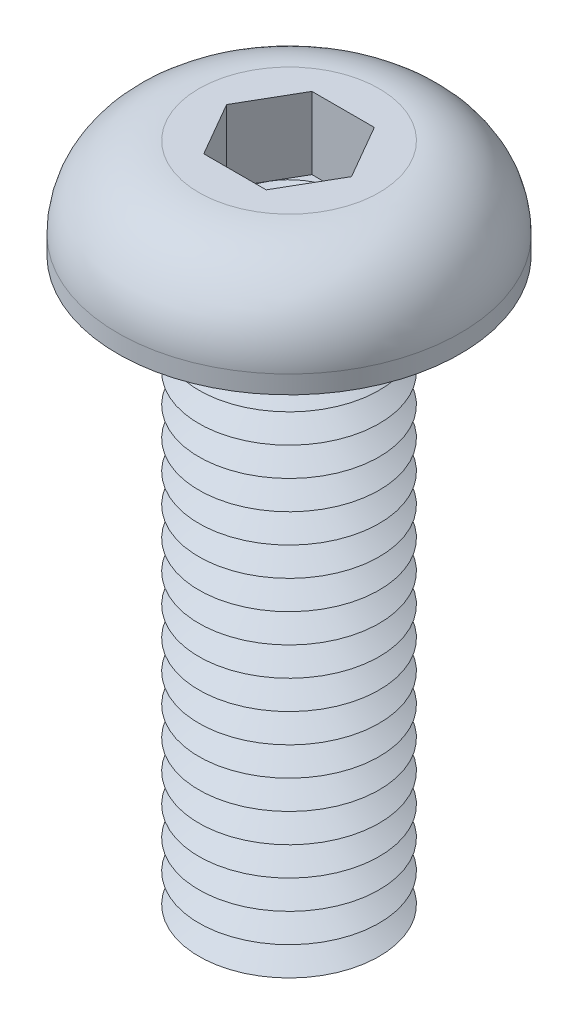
ISO-10303-21;
HEADER;
FILE_DESCRIPTION(('STEP AP214'),'2;1');
FILE_NAME('part.step','',(''),(''),'','','');
FILE_SCHEMA(('AUTOMOTIVE_DESIGN { 1 0 10303 214 1 1 1 1 }'));
ENDSEC;
DATA;
#1=APPLICATION_CONTEXT('core data for automotive mechanical design processes');
#2=APPLICATION_PROTOCOL_DEFINITION('international standard','automotive_design',2000,#1);
#3=PRODUCT_CONTEXT('',#1,'mechanical');
#4=PRODUCT('Part','Part','',(#3));
#5=PRODUCT_RELATED_PRODUCT_CATEGORY('part','',(#4));
#6=PRODUCT_DEFINITION_FORMATION('','',#4);
#7=PRODUCT_DEFINITION_CONTEXT('part definition',#1,'design');
#8=PRODUCT_DEFINITION('design','',#6,#7);
#9=PRODUCT_DEFINITION_SHAPE('','',#8);
#10=(LENGTH_UNIT() NAMED_UNIT(*) SI_UNIT(.MILLI.,.METRE.));
#11=(NAMED_UNIT(*) PLANE_ANGLE_UNIT() SI_UNIT($,.RADIAN.));
#12=(NAMED_UNIT(*) SI_UNIT($,.STERADIAN.) SOLID_ANGLE_UNIT());
#13=UNCERTAINTY_MEASURE_WITH_UNIT(LENGTH_MEASURE(1.E-05),#10,'distance_accuracy_value','');
#14=(GEOMETRIC_REPRESENTATION_CONTEXT(3) GLOBAL_UNCERTAINTY_ASSIGNED_CONTEXT((#13)) GLOBAL_UNIT_ASSIGNED_CONTEXT((#10,
#11,#12)) REPRESENTATION_CONTEXT('',''));
#15=CARTESIAN_POINT('',(0.,0.,0.));
#16=DIRECTION('',(0.,0.,1.));
#17=DIRECTION('',(1.,0.,0.));
#18=AXIS2_PLACEMENT_3D('',#15,#16,#17);
#19=CARTESIAN_POINT('',(0.,0.,0.));
#20=DIRECTION('',(0.,-1.,0.));
#21=DIRECTION('',(0.,0.,-1.));
#22=AXIS2_PLACEMENT_3D('',#19,#20,#21);
#23=TOROIDAL_SURFACE('',#22,2.9,0.4);
#24=CARTESIAN_POINT('',(0.,0.,-3.3));
#25=VERTEX_POINT('',#24);
#26=VERTEX_LOOP('',#25);
#27=FACE_BOUND('',#26,.T.);
#28=ADVANCED_FACE('P0_F12',(#27),#23,.T.);
#29=CLOSED_SHELL('',(#28));
#30=MANIFOLD_SOLID_BREP('P0_B1',#29);
#31=CARTESIAN_POINT('',(0.866025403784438,0.75,-1.5));
#32=DIRECTION('',(0.,1.,0.));
#33=DIRECTION('',(0.,0.,1.));
#34=AXIS2_PLACEMENT_3D('',#31,#32,#33);
#35=PLANE('',#34);
#36=CARTESIAN_POINT('',(0.,0.75,0.));
#37=DIRECTION('',(0.,1.,0.));
#38=DIRECTION('',(0.,0.,1.));
#39=AXIS2_PLACEMENT_3D('',#36,#37,#38);
#40=CIRCLE('',#39,1.5);
#41=CARTESIAN_POINT('',(0.,0.75,1.5));
#42=VERTEX_POINT('',#41);
#43=CARTESIAN_POINT('',(1.29903810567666,0.75,0.75));
#44=VERTEX_POINT('',#43);
#45=EDGE_CURVE('P1_E93',#42,#44,#40,.T.);
#46=ORIENTED_EDGE('',*,*,#45,.F.);
#47=DIRECTION('',(1.,0.,0.));
#48=VECTOR('',#47,1.);
#49=CARTESIAN_POINT('',(-0.866025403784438,0.75,1.5));
#50=LINE('',#49,#48);
#51=CARTESIAN_POINT('',(0.866025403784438,0.75,1.5));
#52=VERTEX_POINT('',#51);
#53=EDGE_CURVE('P1_E116',#42,#52,#50,.T.);
#54=ORIENTED_EDGE('',*,*,#53,.T.);
#55=DIRECTION('',(0.5,0.,-0.866025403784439));
#56=VECTOR('',#55,1.);
#57=CARTESIAN_POINT('',(0.866025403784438,0.75,1.5));
#58=LINE('',#57,#56);
#59=EDGE_CURVE('P1_E112',#52,#44,#58,.T.);
#60=ORIENTED_EDGE('',*,*,#59,.T.);
#61=EDGE_LOOP('',(#46,#54,#60));
#62=FACE_BOUND('',#61,.T.);
#63=ADVANCED_FACE('P1_F15',(#62),#35,.T.);
#64=CARTESIAN_POINT('',(0.,0.75,0.));
#65=DIRECTION('',(0.,1.,0.));
#66=DIRECTION('',(0.,0.,1.));
#67=AXIS2_PLACEMENT_3D('',#64,#65,#66);
#68=CIRCLE('',#67,1.5);
#69=CARTESIAN_POINT('',(1.29903810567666,0.75,-0.750000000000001));
#70=VERTEX_POINT('',#69);
#71=EDGE_CURVE('P1_E10',#44,#70,#68,.T.);
#72=ORIENTED_EDGE('',*,*,#71,.F.);
#73=CARTESIAN_POINT('',(1.73205080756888,0.75,0.));
#74=VERTEX_POINT('',#73);
#75=EDGE_CURVE('P1_E104',#44,#74,#58,.T.);
#76=ORIENTED_EDGE('',*,*,#75,.T.);
#77=DIRECTION('',(-0.5,0.,-0.866025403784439));
#78=VECTOR('',#77,1.);
#79=CARTESIAN_POINT('',(1.73205080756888,0.75,0.));
#80=LINE('',#79,#78);
#81=EDGE_CURVE('P1_E107',#74,#70,#80,.T.);
#82=ORIENTED_EDGE('',*,*,#81,.T.);
#83=EDGE_LOOP('',(#72,#76,#82));
#84=FACE_BOUND('',#83,.T.);
#85=ADVANCED_FACE('P1_F103',(#84),#35,.T.);
#86=CARTESIAN_POINT('',(0.,0.75,-1.5));
#87=VERTEX_POINT('',#86);
#88=EDGE_CURVE('P1_E24',#70,#87,#68,.T.);
#89=ORIENTED_EDGE('',*,*,#88,.F.);
#90=CARTESIAN_POINT('',(0.866025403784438,0.75,-1.5));
#91=VERTEX_POINT('',#90);
#92=EDGE_CURVE('P1_E139',#70,#91,#80,.T.);
#93=ORIENTED_EDGE('',*,*,#92,.T.);
#94=DIRECTION('',(-1.,0.,0.));
#95=VECTOR('',#94,1.);
#96=CARTESIAN_POINT('',(0.866025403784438,0.75,-1.5));
#97=LINE('',#96,#95);
#98=EDGE_CURVE('P1_E336',#91,#87,#97,.T.);
#99=ORIENTED_EDGE('',*,*,#98,.T.);
#100=EDGE_LOOP('',(#89,#93,#99));
#101=FACE_BOUND('',#100,.T.);
#102=ADVANCED_FACE('P1_F301',(#101),#35,.T.);
#103=CARTESIAN_POINT('',(-1.29903810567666,0.75,-0.75));
#104=VERTEX_POINT('',#103);
#105=EDGE_CURVE('P1_E331',#87,#104,#68,.T.);
#106=ORIENTED_EDGE('',*,*,#105,.F.);
#107=CARTESIAN_POINT('',(-0.866025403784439,0.75,-1.5));
#108=VERTEX_POINT('',#107);
#109=EDGE_CURVE('P1_E340',#87,#108,#97,.T.);
#110=ORIENTED_EDGE('',*,*,#109,.T.);
#111=DIRECTION('',(-0.5,0.,0.866025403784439));
#112=VECTOR('',#111,1.);
#113=CARTESIAN_POINT('',(-0.866025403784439,0.75,-1.5));
#114=LINE('',#113,#112);
#115=EDGE_CURVE('P1_E335',#108,#104,#114,.T.);
#116=ORIENTED_EDGE('',*,*,#115,.T.);
#117=EDGE_LOOP('',(#106,#110,#116));
#118=FACE_BOUND('',#117,.T.);
#119=ADVANCED_FACE('P1_F315',(#118),#35,.T.);
#120=CARTESIAN_POINT('',(-1.29903810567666,0.75,0.75));
#121=VERTEX_POINT('',#120);
#122=EDGE_CURVE('P1_E31',#104,#121,#68,.T.);
#123=ORIENTED_EDGE('',*,*,#122,.F.);
#124=CARTESIAN_POINT('',(-1.73205080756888,0.75,0.));
#125=VERTEX_POINT('',#124);
#126=EDGE_CURVE('P1_E327',#104,#125,#114,.T.);
#127=ORIENTED_EDGE('',*,*,#126,.T.);
#128=DIRECTION('',(0.5,0.,0.866025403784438));
#129=VECTOR('',#128,1.);
#130=CARTESIAN_POINT('',(-1.73205080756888,0.75,0.));
#131=LINE('',#130,#129);
#132=EDGE_CURVE('P1_E330',#125,#121,#131,.T.);
#133=ORIENTED_EDGE('',*,*,#132,.T.);
#134=EDGE_LOOP('',(#123,#127,#133));
#135=FACE_BOUND('',#134,.T.);
#136=ADVANCED_FACE('P1_F306',(#135),#35,.T.);
#137=CARTESIAN_POINT('',(0.,-15.2,0.));
#138=DIRECTION('',(0.,1.,0.));
#139=DIRECTION('',(0.,0.,1.));
#140=AXIS2_PLACEMENT_3D('',#137,#138,#139);
#141=CONICAL_SURFACE('',#140,1.80717967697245,1.0471975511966);
#142=CARTESIAN_POINT('',(0.,-14.8,0.));
#143=DIRECTION('',(0.,-1.,0.));
#144=DIRECTION('',(0.,0.,-1.));
#145=AXIS2_PLACEMENT_3D('',#142,#143,#144);
#146=CIRCLE('',#145,2.5);
#147=CARTESIAN_POINT('',(0.,-14.8,-2.5));
#148=VERTEX_POINT('',#147);
#149=EDGE_CURVE('P1_E263',#148,#148,#146,.T.);
#150=ORIENTED_EDGE('',*,*,#149,.T.);
#151=EDGE_LOOP('',(#150));
#152=FACE_BOUND('',#151,.T.);
#153=CARTESIAN_POINT('',(0.,-15.2,0.));
#154=DIRECTION('',(0.,-1.,0.));
#155=DIRECTION('',(0.,0.,-1.));
#156=AXIS2_PLACEMENT_3D('',#153,#154,#155);
#157=CIRCLE('',#156,1.80717967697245);
#158=CARTESIAN_POINT('',(0.,-15.2,-1.80717967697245));
#159=VERTEX_POINT('',#158);
#160=EDGE_CURVE('P1_E266',#159,#159,#157,.T.);
#161=ORIENTED_EDGE('',*,*,#160,.F.);
#162=EDGE_LOOP('',(#161));
#163=FACE_BOUND('',#162,.T.);
#164=ADVANCED_FACE('P1_F314',(#152,#163),#141,.T.);
#165=CARTESIAN_POINT('',(0.,-15.6,0.));
#166=DIRECTION('',(0.,-1.,0.));
#167=DIRECTION('',(0.,0.,-1.));
#168=AXIS2_PLACEMENT_3D('',#165,#166,#167);
#169=CONICAL_SURFACE('',#168,2.5,1.0471975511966);
#170=ORIENTED_EDGE('',*,*,#160,.T.);
#171=EDGE_LOOP('',(#170));
#172=FACE_BOUND('',#171,.T.);
#173=CARTESIAN_POINT('',(0.,-15.6,0.));
#174=DIRECTION('',(0.,-1.,0.));
#175=DIRECTION('',(0.,0.,-1.));
#176=AXIS2_PLACEMENT_3D('',#173,#174,#175);
#177=CIRCLE('',#176,2.5);
#178=CARTESIAN_POINT('',(0.,-15.6,-2.5));
#179=VERTEX_POINT('',#178);
#180=EDGE_CURVE('P1_E269',#179,#179,#177,.T.);
#181=ORIENTED_EDGE('',*,*,#180,.F.);
#182=EDGE_LOOP('',(#181));
#183=FACE_BOUND('',#182,.T.);
#184=ADVANCED_FACE('P1_F321',(#172,#183),#169,.T.);
#185=CARTESIAN_POINT('',(0.,-16.,0.));
#186=DIRECTION('',(0.,1.,0.));
#187=DIRECTION('',(0.,0.,1.));
#188=AXIS2_PLACEMENT_3D('',#185,#186,#187);
#189=PLANE('',#188);
#190=CARTESIAN_POINT('',(0.,-16.,0.));
#191=DIRECTION('',(0.,-1.,0.));
#192=DIRECTION('',(0.,0.,-1.));
#193=AXIS2_PLACEMENT_3D('',#190,#191,#192);
#194=CIRCLE('',#193,1.80717967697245);
#195=CARTESIAN_POINT('',(0.,-16.,-1.80717967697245));
#196=VERTEX_POINT('',#195);
#197=EDGE_CURVE('P1_E272',#196,#196,#194,.T.);
#198=ORIENTED_EDGE('',*,*,#197,.T.);
#199=EDGE_LOOP('',(#198));
#200=FACE_BOUND('',#199,.T.);
#201=ADVANCED_FACE('P1_F399',(#200),#189,.F.);
#202=CARTESIAN_POINT('',(0.,-16.,0.));
#203=DIRECTION('',(0.,1.,0.));
#204=DIRECTION('',(0.,0.,1.));
#205=AXIS2_PLACEMENT_3D('',#202,#203,#204);
#206=CONICAL_SURFACE('',#205,1.80717967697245,1.0471975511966);
#207=ORIENTED_EDGE('',*,*,#180,.T.);
#208=EDGE_LOOP('',(#207));
#209=FACE_BOUND('',#208,.T.);
#210=ORIENTED_EDGE('',*,*,#197,.F.);
#211=EDGE_LOOP('',(#210));
#212=FACE_BOUND('',#211,.T.);
#213=ADVANCED_FACE('P1_F410',(#209,#212),#206,.T.);
#214=CARTESIAN_POINT('',(0.,-14.4,0.));
#215=DIRECTION('',(0.,1.,0.));
#216=DIRECTION('',(0.,0.,1.));
#217=AXIS2_PLACEMENT_3D('',#214,#215,#216);
#218=CONICAL_SURFACE('',#217,1.80717967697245,1.0471975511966);
#219=CARTESIAN_POINT('',(0.,-14.,0.));
#220=DIRECTION('',(0.,-1.,0.));
#221=DIRECTION('',(0.,0.,-1.));
#222=AXIS2_PLACEMENT_3D('',#219,#220,#221);
#223=CIRCLE('',#222,2.5);
#224=CARTESIAN_POINT('',(0.,-14.,-2.5));
#225=VERTEX_POINT('',#224);
#226=EDGE_CURVE('P1_E257',#225,#225,#223,.T.);
#227=ORIENTED_EDGE('',*,*,#226,.T.);
#228=EDGE_LOOP('',(#227));
#229=FACE_BOUND('',#228,.T.);
#230=CARTESIAN_POINT('',(0.,-14.4,0.));
#231=DIRECTION('',(0.,-1.,0.));
#232=DIRECTION('',(0.,0.,-1.));
#233=AXIS2_PLACEMENT_3D('',#230,#231,#232);
#234=CIRCLE('',#233,1.80717967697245);
#235=CARTESIAN_POINT('',(0.,-14.4,-1.80717967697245));
#236=VERTEX_POINT('',#235);
#237=EDGE_CURVE('P1_E260',#236,#236,#234,.T.);
#238=ORIENTED_EDGE('',*,*,#237,.F.);
#239=EDGE_LOOP('',(#238));
#240=FACE_BOUND('',#239,.T.);
#241=ADVANCED_FACE('P1_F419',(#229,#240),#218,.T.);
#242=CARTESIAN_POINT('',(0.,-14.8,0.));
#243=DIRECTION('',(0.,-1.,0.));
#244=DIRECTION('',(0.,0.,-1.));
#245=AXIS2_PLACEMENT_3D('',#242,#243,#244);
#246=CONICAL_SURFACE('',#245,2.5,1.0471975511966);
#247=ORIENTED_EDGE('',*,*,#237,.T.);
#248=EDGE_LOOP('',(#247));
#249=FACE_BOUND('',#248,.T.);
#250=ORIENTED_EDGE('',*,*,#149,.F.);
#251=EDGE_LOOP('',(#250));
#252=FACE_BOUND('',#251,.T.);
#253=ADVANCED_FACE('P1_F428',(#249,#252),#246,.T.);
#254=CARTESIAN_POINT('',(0.,-13.6,0.));
#255=DIRECTION('',(0.,1.,0.));
#256=DIRECTION('',(0.,0.,1.));
#257=AXIS2_PLACEMENT_3D('',#254,#255,#256);
#258=CONICAL_SURFACE('',#257,1.80717967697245,1.0471975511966);
#259=CARTESIAN_POINT('',(0.,-13.2,0.));
#260=DIRECTION('',(0.,-1.,0.));
#261=DIRECTION('',(0.,0.,-1.));
#262=AXIS2_PLACEMENT_3D('',#259,#260,#261);
#263=CIRCLE('',#262,2.5);
#264=CARTESIAN_POINT('',(0.,-13.2,-2.5));
#265=VERTEX_POINT('',#264);
#266=EDGE_CURVE('P1_E251',#265,#265,#263,.T.);
#267=ORIENTED_EDGE('',*,*,#266,.T.);
#268=EDGE_LOOP('',(#267));
#269=FACE_BOUND('',#268,.T.);
#270=CARTESIAN_POINT('',(0.,-13.6,0.));
#271=DIRECTION('',(0.,-1.,0.));
#272=DIRECTION('',(0.,0.,-1.));
#273=AXIS2_PLACEMENT_3D('',#270,#271,#272);
#274=CIRCLE('',#273,1.80717967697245);
#275=CARTESIAN_POINT('',(0.,-13.6,-1.80717967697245));
#276=VERTEX_POINT('',#275);
#277=EDGE_CURVE('P1_E254',#276,#276,#274,.T.);
#278=ORIENTED_EDGE('',*,*,#277,.F.);
#279=EDGE_LOOP('',(#278));
#280=FACE_BOUND('',#279,.T.);
#281=ADVANCED_FACE('P1_F438',(#269,#280),#258,.T.);
#282=CARTESIAN_POINT('',(0.,-14.,0.));
#283=DIRECTION('',(0.,-1.,0.));
#284=DIRECTION('',(0.,0.,-1.));
#285=AXIS2_PLACEMENT_3D('',#282,#283,#284);
#286=CONICAL_SURFACE('',#285,2.5,1.0471975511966);
#287=ORIENTED_EDGE('',*,*,#277,.T.);
#288=EDGE_LOOP('',(#287));
#289=FACE_BOUND('',#288,.T.);
#290=ORIENTED_EDGE('',*,*,#226,.F.);
#291=EDGE_LOOP('',(#290));
#292=FACE_BOUND('',#291,.T.);
#293=ADVANCED_FACE('P1_F448',(#289,#292),#286,.T.);
#294=CARTESIAN_POINT('',(0.,-12.8,0.));
#295=DIRECTION('',(0.,1.,0.));
#296=DIRECTION('',(0.,0.,1.));
#297=AXIS2_PLACEMENT_3D('',#294,#295,#296);
#298=CONICAL_SURFACE('',#297,1.80717967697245,1.0471975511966);
#299=CARTESIAN_POINT('',(0.,-12.4,0.));
#300=DIRECTION('',(0.,-1.,0.));
#301=DIRECTION('',(0.,0.,-1.));
#302=AXIS2_PLACEMENT_3D('',#299,#300,#301);
#303=CIRCLE('',#302,2.5);
#304=CARTESIAN_POINT('',(0.,-12.4,-2.5));
#305=VERTEX_POINT('',#304);
#306=EDGE_CURVE('P1_E245',#305,#305,#303,.T.);
#307=ORIENTED_EDGE('',*,*,#306,.T.);
#308=EDGE_LOOP('',(#307));
#309=FACE_BOUND('',#308,.T.);
#310=CARTESIAN_POINT('',(0.,-12.8,0.));
#311=DIRECTION('',(0.,-1.,0.));
#312=DIRECTION('',(0.,0.,-1.));
#313=AXIS2_PLACEMENT_3D('',#310,#311,#312);
#314=CIRCLE('',#313,1.80717967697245);
#315=CARTESIAN_POINT('',(0.,-12.8,-1.80717967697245));
#316=VERTEX_POINT('',#315);
#317=EDGE_CURVE('P1_E248',#316,#316,#314,.T.);
#318=ORIENTED_EDGE('',*,*,#317,.F.);
#319=EDGE_LOOP('',(#318));
#320=FACE_BOUND('',#319,.T.);
#321=ADVANCED_FACE('P1_F458',(#309,#320),#298,.T.);
#322=CARTESIAN_POINT('',(0.,-13.2,0.));
#323=DIRECTION('',(0.,-1.,0.));
#324=DIRECTION('',(0.,0.,-1.));
#325=AXIS2_PLACEMENT_3D('',#322,#323,#324);
#326=CONICAL_SURFACE('',#325,2.5,1.0471975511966);
#327=ORIENTED_EDGE('',*,*,#317,.T.);
#328=EDGE_LOOP('',(#327));
#329=FACE_BOUND('',#328,.T.);
#330=ORIENTED_EDGE('',*,*,#266,.F.);
#331=EDGE_LOOP('',(#330));
#332=FACE_BOUND('',#331,.T.);
#333=ADVANCED_FACE('P1_F468',(#329,#332),#326,.T.);
#334=CARTESIAN_POINT('',(0.,-12.,0.));
#335=DIRECTION('',(0.,1.,0.));
#336=DIRECTION('',(0.,0.,1.));
#337=AXIS2_PLACEMENT_3D('',#334,#335,#336);
#338=CONICAL_SURFACE('',#337,1.80717967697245,1.0471975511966);
#339=CARTESIAN_POINT('',(0.,-11.6,0.));
#340=DIRECTION('',(0.,-1.,0.));
#341=DIRECTION('',(0.,0.,-1.));
#342=AXIS2_PLACEMENT_3D('',#339,#340,#341);
#343=CIRCLE('',#342,2.5);
#344=CARTESIAN_POINT('',(0.,-11.6,-2.5));
#345=VERTEX_POINT('',#344);
#346=EDGE_CURVE('P1_E239',#345,#345,#343,.T.);
#347=ORIENTED_EDGE('',*,*,#346,.T.);
#348=EDGE_LOOP('',(#347));
#349=FACE_BOUND('',#348,.T.);
#350=CARTESIAN_POINT('',(0.,-12.,0.));
#351=DIRECTION('',(0.,-1.,0.));
#352=DIRECTION('',(0.,0.,-1.));
#353=AXIS2_PLACEMENT_3D('',#350,#351,#352);
#354=CIRCLE('',#353,1.80717967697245);
#355=CARTESIAN_POINT('',(0.,-12.,-1.80717967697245));
#356=VERTEX_POINT('',#355);
#357=EDGE_CURVE('P1_E242',#356,#356,#354,.T.);
#358=ORIENTED_EDGE('',*,*,#357,.F.);
#359=EDGE_LOOP('',(#358));
#360=FACE_BOUND('',#359,.T.);
#361=ADVANCED_FACE('P1_F478',(#349,#360),#338,.T.);
#362=CARTESIAN_POINT('',(0.,-12.4,0.));
#363=DIRECTION('',(0.,-1.,0.));
#364=DIRECTION('',(0.,0.,-1.));
#365=AXIS2_PLACEMENT_3D('',#362,#363,#364);
#366=CONICAL_SURFACE('',#365,2.5,1.0471975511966);
#367=ORIENTED_EDGE('',*,*,#357,.T.);
#368=EDGE_LOOP('',(#367));
#369=FACE_BOUND('',#368,.T.);
#370=ORIENTED_EDGE('',*,*,#306,.F.);
#371=EDGE_LOOP('',(#370));
#372=FACE_BOUND('',#371,.T.);
#373=ADVANCED_FACE('P1_F488',(#369,#372),#366,.T.);
#374=CARTESIAN_POINT('',(0.,-11.2,0.));
#375=DIRECTION('',(0.,1.,0.));
#376=DIRECTION('',(0.,0.,1.));
#377=AXIS2_PLACEMENT_3D('',#374,#375,#376);
#378=CONICAL_SURFACE('',#377,1.80717967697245,1.0471975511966);
#379=CARTESIAN_POINT('',(0.,-10.8,0.));
#380=DIRECTION('',(0.,-1.,0.));
#381=DIRECTION('',(0.,0.,-1.));
#382=AXIS2_PLACEMENT_3D('',#379,#380,#381);
#383=CIRCLE('',#382,2.5);
#384=CARTESIAN_POINT('',(0.,-10.8,-2.5));
#385=VERTEX_POINT('',#384);
#386=EDGE_CURVE('P1_E233',#385,#385,#383,.T.);
#387=ORIENTED_EDGE('',*,*,#386,.T.);
#388=EDGE_LOOP('',(#387));
#389=FACE_BOUND('',#388,.T.);
#390=CARTESIAN_POINT('',(0.,-11.2,0.));
#391=DIRECTION('',(0.,-1.,0.));
#392=DIRECTION('',(0.,0.,-1.));
#393=AXIS2_PLACEMENT_3D('',#390,#391,#392);
#394=CIRCLE('',#393,1.80717967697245);
#395=CARTESIAN_POINT('',(0.,-11.2,-1.80717967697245));
#396=VERTEX_POINT('',#395);
#397=EDGE_CURVE('P1_E236',#396,#396,#394,.T.);
#398=ORIENTED_EDGE('',*,*,#397,.F.);
#399=EDGE_LOOP('',(#398));
#400=FACE_BOUND('',#399,.T.);
#401=ADVANCED_FACE('P1_F498',(#389,#400),#378,.T.);
#402=CARTESIAN_POINT('',(0.,-11.6,0.));
#403=DIRECTION('',(0.,-1.,0.));
#404=DIRECTION('',(0.,0.,-1.));
#405=AXIS2_PLACEMENT_3D('',#402,#403,#404);
#406=CONICAL_SURFACE('',#405,2.5,1.0471975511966);
#407=ORIENTED_EDGE('',*,*,#397,.T.);
#408=EDGE_LOOP('',(#407));
#409=FACE_BOUND('',#408,.T.);
#410=ORIENTED_EDGE('',*,*,#346,.F.);
#411=EDGE_LOOP('',(#410));
#412=FACE_BOUND('',#411,.T.);
#413=ADVANCED_FACE('P1_F508',(#409,#412),#406,.T.);
#414=CARTESIAN_POINT('',(0.,-10.4,0.));
#415=DIRECTION('',(0.,1.,0.));
#416=DIRECTION('',(0.,0.,1.));
#417=AXIS2_PLACEMENT_3D('',#414,#415,#416);
#418=CONICAL_SURFACE('',#417,1.80717967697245,1.0471975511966);
#419=CARTESIAN_POINT('',(0.,-10.,0.));
#420=DIRECTION('',(0.,-1.,0.));
#421=DIRECTION('',(0.,0.,-1.));
#422=AXIS2_PLACEMENT_3D('',#419,#420,#421);
#423=CIRCLE('',#422,2.5);
#424=CARTESIAN_POINT('',(0.,-10.,-2.5));
#425=VERTEX_POINT('',#424);
#426=EDGE_CURVE('P1_E227',#425,#425,#423,.T.);
#427=ORIENTED_EDGE('',*,*,#426,.T.);
#428=EDGE_LOOP('',(#427));
#429=FACE_BOUND('',#428,.T.);
#430=CARTESIAN_POINT('',(0.,-10.4,0.));
#431=DIRECTION('',(0.,-1.,0.));
#432=DIRECTION('',(0.,0.,-1.));
#433=AXIS2_PLACEMENT_3D('',#430,#431,#432);
#434=CIRCLE('',#433,1.80717967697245);
#435=CARTESIAN_POINT('',(0.,-10.4,-1.80717967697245));
#436=VERTEX_POINT('',#435);
#437=EDGE_CURVE('P1_E230',#436,#436,#434,.T.);
#438=ORIENTED_EDGE('',*,*,#437,.F.);
#439=EDGE_LOOP('',(#438));
#440=FACE_BOUND('',#439,.T.);
#441=ADVANCED_FACE('P1_F518',(#429,#440),#418,.T.);
#442=CARTESIAN_POINT('',(0.,-10.8,0.));
#443=DIRECTION('',(0.,-1.,0.));
#444=DIRECTION('',(0.,0.,-1.));
#445=AXIS2_PLACEMENT_3D('',#442,#443,#444);
#446=CONICAL_SURFACE('',#445,2.5,1.0471975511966);
#447=ORIENTED_EDGE('',*,*,#437,.T.);
#448=EDGE_LOOP('',(#447));
#449=FACE_BOUND('',#448,.T.);
#450=ORIENTED_EDGE('',*,*,#386,.F.);
#451=EDGE_LOOP('',(#450));
#452=FACE_BOUND('',#451,.T.);
#453=ADVANCED_FACE('P1_F528',(#449,#452),#446,.T.);
#454=CARTESIAN_POINT('',(0.,-9.6,0.));
#455=DIRECTION('',(0.,1.,0.));
#456=DIRECTION('',(0.,0.,1.));
#457=AXIS2_PLACEMENT_3D('',#454,#455,#456);
#458=CONICAL_SURFACE('',#457,1.80717967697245,1.0471975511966);
#459=CARTESIAN_POINT('',(0.,-9.2,0.));
#460=DIRECTION('',(0.,-1.,0.));
#461=DIRECTION('',(0.,0.,-1.));
#462=AXIS2_PLACEMENT_3D('',#459,#460,#461);
#463=CIRCLE('',#462,2.5);
#464=CARTESIAN_POINT('',(0.,-9.2,-2.5));
#465=VERTEX_POINT('',#464);
#466=EDGE_CURVE('P1_E221',#465,#465,#463,.T.);
#467=ORIENTED_EDGE('',*,*,#466,.T.);
#468=EDGE_LOOP('',(#467));
#469=FACE_BOUND('',#468,.T.);
#470=CARTESIAN_POINT('',(0.,-9.6,0.));
#471=DIRECTION('',(0.,-1.,0.));
#472=DIRECTION('',(0.,0.,-1.));
#473=AXIS2_PLACEMENT_3D('',#470,#471,#472);
#474=CIRCLE('',#473,1.80717967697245);
#475=CARTESIAN_POINT('',(0.,-9.6,-1.80717967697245));
#476=VERTEX_POINT('',#475);
#477=EDGE_CURVE('P1_E224',#476,#476,#474,.T.);
#478=ORIENTED_EDGE('',*,*,#477,.F.);
#479=EDGE_LOOP('',(#478));
#480=FACE_BOUND('',#479,.T.);
#481=ADVANCED_FACE('P1_F538',(#469,#480),#458,.T.);
#482=CARTESIAN_POINT('',(0.,-10.,0.));
#483=DIRECTION('',(0.,-1.,0.));
#484=DIRECTION('',(0.,0.,-1.));
#485=AXIS2_PLACEMENT_3D('',#482,#483,#484);
#486=CONICAL_SURFACE('',#485,2.5,1.0471975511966);
#487=ORIENTED_EDGE('',*,*,#477,.T.);
#488=EDGE_LOOP('',(#487));
#489=FACE_BOUND('',#488,.T.);
#490=ORIENTED_EDGE('',*,*,#426,.F.);
#491=EDGE_LOOP('',(#490));
#492=FACE_BOUND('',#491,.T.);
#493=ADVANCED_FACE('P1_F548',(#489,#492),#486,.T.);
#494=CARTESIAN_POINT('',(0.,-8.8,0.));
#495=DIRECTION('',(0.,1.,0.));
#496=DIRECTION('',(0.,0.,1.));
#497=AXIS2_PLACEMENT_3D('',#494,#495,#496);
#498=CONICAL_SURFACE('',#497,1.80717967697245,1.0471975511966);
#499=CARTESIAN_POINT('',(0.,-8.4,0.));
#500=DIRECTION('',(0.,-1.,0.));
#501=DIRECTION('',(0.,0.,-1.));
#502=AXIS2_PLACEMENT_3D('',#499,#500,#501);
#503=CIRCLE('',#502,2.5);
#504=CARTESIAN_POINT('',(0.,-8.4,-2.5));
#505=VERTEX_POINT('',#504);
#506=EDGE_CURVE('P1_E215',#505,#505,#503,.T.);
#507=ORIENTED_EDGE('',*,*,#506,.T.);
#508=EDGE_LOOP('',(#507));
#509=FACE_BOUND('',#508,.T.);
#510=CARTESIAN_POINT('',(0.,-8.8,0.));
#511=DIRECTION('',(0.,-1.,0.));
#512=DIRECTION('',(0.,0.,-1.));
#513=AXIS2_PLACEMENT_3D('',#510,#511,#512);
#514=CIRCLE('',#513,1.80717967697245);
#515=CARTESIAN_POINT('',(0.,-8.8,-1.80717967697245));
#516=VERTEX_POINT('',#515);
#517=EDGE_CURVE('P1_E218',#516,#516,#514,.T.);
#518=ORIENTED_EDGE('',*,*,#517,.F.);
#519=EDGE_LOOP('',(#518));
#520=FACE_BOUND('',#519,.T.);
#521=ADVANCED_FACE('P1_F558',(#509,#520),#498,.T.);
#522=CARTESIAN_POINT('',(0.,-9.2,0.));
#523=DIRECTION('',(0.,-1.,0.));
#524=DIRECTION('',(0.,0.,-1.));
#525=AXIS2_PLACEMENT_3D('',#522,#523,#524);
#526=CONICAL_SURFACE('',#525,2.5,1.0471975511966);
#527=ORIENTED_EDGE('',*,*,#517,.T.);
#528=EDGE_LOOP('',(#527));
#529=FACE_BOUND('',#528,.T.);
#530=ORIENTED_EDGE('',*,*,#466,.F.);
#531=EDGE_LOOP('',(#530));
#532=FACE_BOUND('',#531,.T.);
#533=ADVANCED_FACE('P1_F568',(#529,#532),#526,.T.);
#534=CARTESIAN_POINT('',(0.,-8.,0.));
#535=DIRECTION('',(0.,1.,0.));
#536=DIRECTION('',(0.,0.,1.));
#537=AXIS2_PLACEMENT_3D('',#534,#535,#536);
#538=CONICAL_SURFACE('',#537,1.80717967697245,1.0471975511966);
#539=CARTESIAN_POINT('',(0.,-7.6,0.));
#540=DIRECTION('',(0.,-1.,0.));
#541=DIRECTION('',(0.,0.,-1.));
#542=AXIS2_PLACEMENT_3D('',#539,#540,#541);
#543=CIRCLE('',#542,2.5);
#544=CARTESIAN_POINT('',(0.,-7.6,-2.5));
#545=VERTEX_POINT('',#544);
#546=EDGE_CURVE('P1_E209',#545,#545,#543,.T.);
#547=ORIENTED_EDGE('',*,*,#546,.T.);
#548=EDGE_LOOP('',(#547));
#549=FACE_BOUND('',#548,.T.);
#550=CARTESIAN_POINT('',(0.,-8.,0.));
#551=DIRECTION('',(0.,-1.,0.));
#552=DIRECTION('',(0.,0.,-1.));
#553=AXIS2_PLACEMENT_3D('',#550,#551,#552);
#554=CIRCLE('',#553,1.80717967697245);
#555=CARTESIAN_POINT('',(0.,-8.,-1.80717967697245));
#556=VERTEX_POINT('',#555);
#557=EDGE_CURVE('P1_E212',#556,#556,#554,.T.);
#558=ORIENTED_EDGE('',*,*,#557,.F.);
#559=EDGE_LOOP('',(#558));
#560=FACE_BOUND('',#559,.T.);
#561=ADVANCED_FACE('P1_F578',(#549,#560),#538,.T.);
#562=CARTESIAN_POINT('',(0.,-8.4,0.));
#563=DIRECTION('',(0.,-1.,0.));
#564=DIRECTION('',(0.,0.,-1.));
#565=AXIS2_PLACEMENT_3D('',#562,#563,#564);
#566=CONICAL_SURFACE('',#565,2.5,1.0471975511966);
#567=ORIENTED_EDGE('',*,*,#557,.T.);
#568=EDGE_LOOP('',(#567));
#569=FACE_BOUND('',#568,.T.);
#570=ORIENTED_EDGE('',*,*,#506,.F.);
#571=EDGE_LOOP('',(#570));
#572=FACE_BOUND('',#571,.T.);
#573=ADVANCED_FACE('P1_F588',(#569,#572),#566,.T.);
#574=CARTESIAN_POINT('',(0.,-7.2,0.));
#575=DIRECTION('',(0.,1.,0.));
#576=DIRECTION('',(0.,0.,1.));
#577=AXIS2_PLACEMENT_3D('',#574,#575,#576);
#578=CONICAL_SURFACE('',#577,1.80717967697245,1.0471975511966);
#579=CARTESIAN_POINT('',(0.,-6.8,0.));
#580=DIRECTION('',(0.,-1.,0.));
#581=DIRECTION('',(0.,0.,-1.));
#582=AXIS2_PLACEMENT_3D('',#579,#580,#581);
#583=CIRCLE('',#582,2.5);
#584=CARTESIAN_POINT('',(0.,-6.8,-2.5));
#585=VERTEX_POINT('',#584);
#586=EDGE_CURVE('P1_E203',#585,#585,#583,.T.);
#587=ORIENTED_EDGE('',*,*,#586,.T.);
#588=EDGE_LOOP('',(#587));
#589=FACE_BOUND('',#588,.T.);
#590=CARTESIAN_POINT('',(0.,-7.2,0.));
#591=DIRECTION('',(0.,-1.,0.));
#592=DIRECTION('',(0.,0.,-1.));
#593=AXIS2_PLACEMENT_3D('',#590,#591,#592);
#594=CIRCLE('',#593,1.80717967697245);
#595=CARTESIAN_POINT('',(0.,-7.2,-1.80717967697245));
#596=VERTEX_POINT('',#595);
#597=EDGE_CURVE('P1_E206',#596,#596,#594,.T.);
#598=ORIENTED_EDGE('',*,*,#597,.F.);
#599=EDGE_LOOP('',(#598));
#600=FACE_BOUND('',#599,.T.);
#601=ADVANCED_FACE('P1_F598',(#589,#600),#578,.T.);
#602=CARTESIAN_POINT('',(0.,-7.6,0.));
#603=DIRECTION('',(0.,-1.,0.));
#604=DIRECTION('',(0.,0.,-1.));
#605=AXIS2_PLACEMENT_3D('',#602,#603,#604);
#606=CONICAL_SURFACE('',#605,2.5,1.0471975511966);
#607=ORIENTED_EDGE('',*,*,#597,.T.);
#608=EDGE_LOOP('',(#607));
#609=FACE_BOUND('',#608,.T.);
#610=ORIENTED_EDGE('',*,*,#546,.F.);
#611=EDGE_LOOP('',(#610));
#612=FACE_BOUND('',#611,.T.);
#613=ADVANCED_FACE('P1_F608',(#609,#612),#606,.T.);
#614=CARTESIAN_POINT('',(0.,-6.4,0.));
#615=DIRECTION('',(0.,1.,0.));
#616=DIRECTION('',(0.,0.,1.));
#617=AXIS2_PLACEMENT_3D('',#614,#615,#616);
#618=CONICAL_SURFACE('',#617,1.80717967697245,1.0471975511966);
#619=CARTESIAN_POINT('',(0.,-6.,0.));
#620=DIRECTION('',(0.,-1.,0.));
#621=DIRECTION('',(0.,0.,-1.));
#622=AXIS2_PLACEMENT_3D('',#619,#620,#621);
#623=CIRCLE('',#622,2.5);
#624=CARTESIAN_POINT('',(0.,-6.,-2.5));
#625=VERTEX_POINT('',#624);
#626=EDGE_CURVE('P1_E197',#625,#625,#623,.T.);
#627=ORIENTED_EDGE('',*,*,#626,.T.);
#628=EDGE_LOOP('',(#627));
#629=FACE_BOUND('',#628,.T.);
#630=CARTESIAN_POINT('',(0.,-6.4,0.));
#631=DIRECTION('',(0.,-1.,0.));
#632=DIRECTION('',(0.,0.,-1.));
#633=AXIS2_PLACEMENT_3D('',#630,#631,#632);
#634=CIRCLE('',#633,1.80717967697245);
#635=CARTESIAN_POINT('',(0.,-6.4,-1.80717967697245));
#636=VERTEX_POINT('',#635);
#637=EDGE_CURVE('P1_E200',#636,#636,#634,.T.);
#638=ORIENTED_EDGE('',*,*,#637,.F.);
#639=EDGE_LOOP('',(#638));
#640=FACE_BOUND('',#639,.T.);
#641=ADVANCED_FACE('P1_F618',(#629,#640),#618,.T.);
#642=CARTESIAN_POINT('',(0.,-6.8,0.));
#643=DIRECTION('',(0.,-1.,0.));
#644=DIRECTION('',(0.,0.,-1.));
#645=AXIS2_PLACEMENT_3D('',#642,#643,#644);
#646=CONICAL_SURFACE('',#645,2.5,1.0471975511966);
#647=ORIENTED_EDGE('',*,*,#637,.T.);
#648=EDGE_LOOP('',(#647));
#649=FACE_BOUND('',#648,.T.);
#650=ORIENTED_EDGE('',*,*,#586,.F.);
#651=EDGE_LOOP('',(#650));
#652=FACE_BOUND('',#651,.T.);
#653=ADVANCED_FACE('P1_F628',(#649,#652),#646,.T.);
#654=CARTESIAN_POINT('',(0.,-5.6,0.));
#655=DIRECTION('',(0.,1.,0.));
#656=DIRECTION('',(0.,0.,1.));
#657=AXIS2_PLACEMENT_3D('',#654,#655,#656);
#658=CONICAL_SURFACE('',#657,1.80717967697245,1.0471975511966);
#659=CARTESIAN_POINT('',(0.,-5.2,0.));
#660=DIRECTION('',(0.,-1.,0.));
#661=DIRECTION('',(0.,0.,-1.));
#662=AXIS2_PLACEMENT_3D('',#659,#660,#661);
#663=CIRCLE('',#662,2.5);
#664=CARTESIAN_POINT('',(0.,-5.2,-2.5));
#665=VERTEX_POINT('',#664);
#666=EDGE_CURVE('P1_E191',#665,#665,#663,.T.);
#667=ORIENTED_EDGE('',*,*,#666,.T.);
#668=EDGE_LOOP('',(#667));
#669=FACE_BOUND('',#668,.T.);
#670=CARTESIAN_POINT('',(0.,-5.6,0.));
#671=DIRECTION('',(0.,-1.,0.));
#672=DIRECTION('',(0.,0.,-1.));
#673=AXIS2_PLACEMENT_3D('',#670,#671,#672);
#674=CIRCLE('',#673,1.80717967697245);
#675=CARTESIAN_POINT('',(0.,-5.6,-1.80717967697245));
#676=VERTEX_POINT('',#675);
#677=EDGE_CURVE('P1_E194',#676,#676,#674,.T.);
#678=ORIENTED_EDGE('',*,*,#677,.F.);
#679=EDGE_LOOP('',(#678));
#680=FACE_BOUND('',#679,.T.);
#681=ADVANCED_FACE('P1_F638',(#669,#680),#658,.T.);
#682=CARTESIAN_POINT('',(0.,-6.,0.));
#683=DIRECTION('',(0.,-1.,0.));
#684=DIRECTION('',(0.,0.,-1.));
#685=AXIS2_PLACEMENT_3D('',#682,#683,#684);
#686=CONICAL_SURFACE('',#685,2.5,1.0471975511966);
#687=ORIENTED_EDGE('',*,*,#677,.T.);
#688=EDGE_LOOP('',(#687));
#689=FACE_BOUND('',#688,.T.);
#690=ORIENTED_EDGE('',*,*,#626,.F.);
#691=EDGE_LOOP('',(#690));
#692=FACE_BOUND('',#691,.T.);
#693=ADVANCED_FACE('P1_F648',(#689,#692),#686,.T.);
#694=CARTESIAN_POINT('',(0.,-4.8,0.));
#695=DIRECTION('',(0.,1.,0.));
#696=DIRECTION('',(0.,0.,1.));
#697=AXIS2_PLACEMENT_3D('',#694,#695,#696);
#698=CONICAL_SURFACE('',#697,1.80717967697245,1.0471975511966);
#699=CARTESIAN_POINT('',(0.,-4.4,0.));
#700=DIRECTION('',(0.,-1.,0.));
#701=DIRECTION('',(0.,0.,-1.));
#702=AXIS2_PLACEMENT_3D('',#699,#700,#701);
#703=CIRCLE('',#702,2.5);
#704=CARTESIAN_POINT('',(0.,-4.4,-2.5));
#705=VERTEX_POINT('',#704);
#706=EDGE_CURVE('P1_E185',#705,#705,#703,.T.);
#707=ORIENTED_EDGE('',*,*,#706,.T.);
#708=EDGE_LOOP('',(#707));
#709=FACE_BOUND('',#708,.T.);
#710=CARTESIAN_POINT('',(0.,-4.8,0.));
#711=DIRECTION('',(0.,-1.,0.));
#712=DIRECTION('',(0.,0.,-1.));
#713=AXIS2_PLACEMENT_3D('',#710,#711,#712);
#714=CIRCLE('',#713,1.80717967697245);
#715=CARTESIAN_POINT('',(0.,-4.8,-1.80717967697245));
#716=VERTEX_POINT('',#715);
#717=EDGE_CURVE('P1_E188',#716,#716,#714,.T.);
#718=ORIENTED_EDGE('',*,*,#717,.F.);
#719=EDGE_LOOP('',(#718));
#720=FACE_BOUND('',#719,.T.);
#721=ADVANCED_FACE('P1_F658',(#709,#720),#698,.T.);
#722=CARTESIAN_POINT('',(0.,-5.2,0.));
#723=DIRECTION('',(0.,-1.,0.));
#724=DIRECTION('',(0.,0.,-1.));
#725=AXIS2_PLACEMENT_3D('',#722,#723,#724);
#726=CONICAL_SURFACE('',#725,2.5,1.0471975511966);
#727=ORIENTED_EDGE('',*,*,#717,.T.);
#728=EDGE_LOOP('',(#727));
#729=FACE_BOUND('',#728,.T.);
#730=ORIENTED_EDGE('',*,*,#666,.F.);
#731=EDGE_LOOP('',(#730));
#732=FACE_BOUND('',#731,.T.);
#733=ADVANCED_FACE('P1_F668',(#729,#732),#726,.T.);
#734=CARTESIAN_POINT('',(0.,-4.,0.));
#735=DIRECTION('',(0.,1.,0.));
#736=DIRECTION('',(0.,0.,1.));
#737=AXIS2_PLACEMENT_3D('',#734,#735,#736);
#738=CONICAL_SURFACE('',#737,1.80717967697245,1.0471975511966);
#739=CARTESIAN_POINT('',(0.,-3.6,0.));
#740=DIRECTION('',(0.,-1.,0.));
#741=DIRECTION('',(0.,0.,-1.));
#742=AXIS2_PLACEMENT_3D('',#739,#740,#741);
#743=CIRCLE('',#742,2.5);
#744=CARTESIAN_POINT('',(0.,-3.6,-2.5));
#745=VERTEX_POINT('',#744);
#746=EDGE_CURVE('P1_E179',#745,#745,#743,.T.);
#747=ORIENTED_EDGE('',*,*,#746,.T.);
#748=EDGE_LOOP('',(#747));
#749=FACE_BOUND('',#748,.T.);
#750=CARTESIAN_POINT('',(0.,-4.,0.));
#751=DIRECTION('',(0.,-1.,0.));
#752=DIRECTION('',(0.,0.,-1.));
#753=AXIS2_PLACEMENT_3D('',#750,#751,#752);
#754=CIRCLE('',#753,1.80717967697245);
#755=CARTESIAN_POINT('',(0.,-4.,-1.80717967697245));
#756=VERTEX_POINT('',#755);
#757=EDGE_CURVE('P1_E182',#756,#756,#754,.T.);
#758=ORIENTED_EDGE('',*,*,#757,.F.);
#759=EDGE_LOOP('',(#758));
#760=FACE_BOUND('',#759,.T.);
#761=ADVANCED_FACE('P1_F678',(#749,#760),#738,.T.);
#762=CARTESIAN_POINT('',(0.,-4.4,0.));
#763=DIRECTION('',(0.,-1.,0.));
#764=DIRECTION('',(0.,0.,-1.));
#765=AXIS2_PLACEMENT_3D('',#762,#763,#764);
#766=CONICAL_SURFACE('',#765,2.5,1.0471975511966);
#767=ORIENTED_EDGE('',*,*,#757,.T.);
#768=EDGE_LOOP('',(#767));
#769=FACE_BOUND('',#768,.T.);
#770=ORIENTED_EDGE('',*,*,#706,.F.);
#771=EDGE_LOOP('',(#770));
#772=FACE_BOUND('',#771,.T.);
#773=ADVANCED_FACE('P1_F688',(#769,#772),#766,.T.);
#774=CARTESIAN_POINT('',(0.,-3.2,0.));
#775=DIRECTION('',(0.,1.,0.));
#776=DIRECTION('',(0.,0.,1.));
#777=AXIS2_PLACEMENT_3D('',#774,#775,#776);
#778=CONICAL_SURFACE('',#777,1.80717967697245,1.0471975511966);
#779=CARTESIAN_POINT('',(0.,-2.8,0.));
#780=DIRECTION('',(0.,-1.,0.));
#781=DIRECTION('',(0.,0.,-1.));
#782=AXIS2_PLACEMENT_3D('',#779,#780,#781);
#783=CIRCLE('',#782,2.5);
#784=CARTESIAN_POINT('',(0.,-2.8,-2.5));
#785=VERTEX_POINT('',#784);
#786=EDGE_CURVE('P1_E173',#785,#785,#783,.T.);
#787=ORIENTED_EDGE('',*,*,#786,.T.);
#788=EDGE_LOOP('',(#787));
#789=FACE_BOUND('',#788,.T.);
#790=CARTESIAN_POINT('',(0.,-3.2,0.));
#791=DIRECTION('',(0.,-1.,0.));
#792=DIRECTION('',(0.,0.,-1.));
#793=AXIS2_PLACEMENT_3D('',#790,#791,#792);
#794=CIRCLE('',#793,1.80717967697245);
#795=CARTESIAN_POINT('',(0.,-3.2,-1.80717967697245));
#796=VERTEX_POINT('',#795);
#797=EDGE_CURVE('P1_E176',#796,#796,#794,.T.);
#798=ORIENTED_EDGE('',*,*,#797,.F.);
#799=EDGE_LOOP('',(#798));
#800=FACE_BOUND('',#799,.T.);
#801=ADVANCED_FACE('P1_F698',(#789,#800),#778,.T.);
#802=CARTESIAN_POINT('',(0.,-3.6,0.));
#803=DIRECTION('',(0.,-1.,0.));
#804=DIRECTION('',(0.,0.,-1.));
#805=AXIS2_PLACEMENT_3D('',#802,#803,#804);
#806=CONICAL_SURFACE('',#805,2.5,1.0471975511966);
#807=ORIENTED_EDGE('',*,*,#797,.T.);
#808=EDGE_LOOP('',(#807));
#809=FACE_BOUND('',#808,.T.);
#810=ORIENTED_EDGE('',*,*,#746,.F.);
#811=EDGE_LOOP('',(#810));
#812=FACE_BOUND('',#811,.T.);
#813=ADVANCED_FACE('P1_F708',(#809,#812),#806,.T.);
#814=CARTESIAN_POINT('',(0.,-2.4,0.));
#815=DIRECTION('',(0.,1.,0.));
#816=DIRECTION('',(0.,0.,1.));
#817=AXIS2_PLACEMENT_3D('',#814,#815,#816);
#818=CONICAL_SURFACE('',#817,1.80717967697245,1.0471975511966);
#819=CARTESIAN_POINT('',(0.,-2.,0.));
#820=DIRECTION('',(0.,-1.,0.));
#821=DIRECTION('',(0.,0.,-1.));
#822=AXIS2_PLACEMENT_3D('',#819,#820,#821);
#823=CIRCLE('',#822,2.5);
#824=CARTESIAN_POINT('',(0.,-2.,-2.5));
#825=VERTEX_POINT('',#824);
#826=EDGE_CURVE('P1_E164',#825,#825,#823,.T.);
#827=ORIENTED_EDGE('',*,*,#826,.T.);
#828=EDGE_LOOP('',(#827));
#829=FACE_BOUND('',#828,.T.);
#830=CARTESIAN_POINT('',(0.,-2.4,0.));
#831=DIRECTION('',(0.,-1.,0.));
#832=DIRECTION('',(0.,0.,-1.));
#833=AXIS2_PLACEMENT_3D('',#830,#831,#832);
#834=CIRCLE('',#833,1.80717967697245);
#835=CARTESIAN_POINT('',(0.,-2.4,-1.80717967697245));
#836=VERTEX_POINT('',#835);
#837=EDGE_CURVE('P1_E170',#836,#836,#834,.T.);
#838=ORIENTED_EDGE('',*,*,#837,.F.);
#839=EDGE_LOOP('',(#838));
#840=FACE_BOUND('',#839,.T.);
#841=ADVANCED_FACE('P1_F718',(#829,#840),#818,.T.);
#842=CARTESIAN_POINT('',(0.,-2.8,0.));
#843=DIRECTION('',(0.,-1.,0.));
#844=DIRECTION('',(0.,0.,-1.));
#845=AXIS2_PLACEMENT_3D('',#842,#843,#844);
#846=CONICAL_SURFACE('',#845,2.5,1.0471975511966);
#847=ORIENTED_EDGE('',*,*,#837,.T.);
#848=EDGE_LOOP('',(#847));
#849=FACE_BOUND('',#848,.T.);
#850=ORIENTED_EDGE('',*,*,#786,.F.);
#851=EDGE_LOOP('',(#850));
#852=FACE_BOUND('',#851,.T.);
#853=ADVANCED_FACE('P1_F728',(#849,#852),#846,.T.);
#854=CARTESIAN_POINT('',(0.,-1.6,0.));
#855=DIRECTION('',(0.,1.,0.));
#856=DIRECTION('',(0.,0.,1.));
#857=AXIS2_PLACEMENT_3D('',#854,#855,#856);
#858=CONICAL_SURFACE('',#857,1.80717967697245,1.0471975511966);
#859=CARTESIAN_POINT('',(0.,-1.2,0.));
#860=DIRECTION('',(0.,-1.,0.));
#861=DIRECTION('',(0.,0.,-1.));
#862=AXIS2_PLACEMENT_3D('',#859,#860,#861);
#863=CIRCLE('',#862,2.5);
#864=CARTESIAN_POINT('',(0.,-1.2,-2.5));
#865=VERTEX_POINT('',#864);
#866=EDGE_CURVE('P1_E167',#865,#865,#863,.T.);
#867=ORIENTED_EDGE('',*,*,#866,.T.);
#868=EDGE_LOOP('',(#867));
#869=FACE_BOUND('',#868,.T.);
#870=CARTESIAN_POINT('',(0.,-1.6,0.));
#871=DIRECTION('',(0.,-1.,0.));
#872=DIRECTION('',(0.,0.,-1.));
#873=AXIS2_PLACEMENT_3D('',#870,#871,#872);
#874=CIRCLE('',#873,1.80717967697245);
#875=CARTESIAN_POINT('',(0.,-1.6,-1.80717967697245));
#876=VERTEX_POINT('',#875);
#877=EDGE_CURVE('P1_E161',#876,#876,#874,.T.);
#878=ORIENTED_EDGE('',*,*,#877,.F.);
#879=EDGE_LOOP('',(#878));
#880=FACE_BOUND('',#879,.T.);
#881=ADVANCED_FACE('P1_F738',(#869,#880),#858,.T.);
#882=CARTESIAN_POINT('',(0.,-2.,0.));
#883=DIRECTION('',(0.,-1.,0.));
#884=DIRECTION('',(0.,0.,-1.));
#885=AXIS2_PLACEMENT_3D('',#882,#883,#884);
#886=CONICAL_SURFACE('',#885,2.5,1.0471975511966);
#887=ORIENTED_EDGE('',*,*,#877,.T.);
#888=EDGE_LOOP('',(#887));
#889=FACE_BOUND('',#888,.T.);
#890=ORIENTED_EDGE('',*,*,#826,.F.);
#891=EDGE_LOOP('',(#890));
#892=FACE_BOUND('',#891,.T.);
#893=ADVANCED_FACE('P1_F748',(#889,#892),#886,.T.);
#894=CARTESIAN_POINT('',(0.,-16.,0.));
#895=DIRECTION('',(0.,1.,0.));
#896=DIRECTION('',(0.,0.,1.));
#897=AXIS2_PLACEMENT_3D('',#894,#895,#896);
#898=CYLINDRICAL_SURFACE('',#897,2.5);
#899=CARTESIAN_POINT('',(0.,0.,0.));
#900=DIRECTION('',(0.,-1.,0.));
#901=DIRECTION('',(1.,0.,0.));
#902=AXIS2_PLACEMENT_3D('',#899,#900,#901);
#903=CIRCLE('',#902,2.5);
#904=CARTESIAN_POINT('',(2.5,0.,0.));
#905=VERTEX_POINT('',#904);
#906=EDGE_CURVE('P1_E141',#905,#905,#903,.F.);
#907=ORIENTED_EDGE('',*,*,#906,.F.);
#908=EDGE_LOOP('',(#907));
#909=FACE_BOUND('',#908,.T.);
#910=ORIENTED_EDGE('',*,*,#866,.F.);
#911=EDGE_LOOP('',(#910));
#912=FACE_BOUND('',#911,.T.);
#913=ADVANCED_FACE('P1_F17',(#909,#912),#898,.T.);
#914=CARTESIAN_POINT('',(0.,0.,0.));
#915=DIRECTION('',(0.,-1.,0.));
#916=DIRECTION('',(0.,0.,-1.));
#917=AXIS2_PLACEMENT_3D('',#914,#915,#916);
#918=TOROIDAL_SURFACE('',#917,2.9,0.4);
#919=ORIENTED_EDGE('',*,*,#906,.T.);
#920=EDGE_LOOP('',(#919));
#921=FACE_BOUND('',#920,.T.);
#922=CARTESIAN_POINT('',(0.,0.,0.));
#923=DIRECTION('',(0.,1.,0.));
#924=DIRECTION('',(-1.,0.,0.));
#925=AXIS2_PLACEMENT_3D('',#922,#923,#924);
#926=CIRCLE('',#925,3.3);
#927=CARTESIAN_POINT('',(-3.3,0.,0.));
#928=VERTEX_POINT('',#927);
#929=EDGE_CURVE('P1_E151',#928,#928,#926,.F.);
#930=ORIENTED_EDGE('',*,*,#929,.T.);
#931=EDGE_LOOP('',(#930));
#932=FACE_BOUND('',#931,.T.);
#933=ADVANCED_FACE('P1_F277',(#921,#932),#918,.F.);
#934=CARTESIAN_POINT('',(2.5,2.75,0.));
#935=DIRECTION('',(0.,-1.,0.));
#936=DIRECTION('',(1.,0.,0.));
#937=AXIS2_PLACEMENT_3D('',#934,#935,#936);
#938=PLANE('',#937);
#939=DIRECTION('',(-1.,0.,0.));
#940=VECTOR('',#939,1.);
#941=CARTESIAN_POINT('',(0.866025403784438,2.75,-1.5));
#942=LINE('',#941,#940);
#943=CARTESIAN_POINT('',(0.866025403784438,2.75,-1.5));
#944=VERTEX_POINT('',#943);
#945=CARTESIAN_POINT('',(-0.866025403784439,2.75,-1.5));
#946=VERTEX_POINT('',#945);
#947=EDGE_CURVE('P1_E125',#944,#946,#942,.T.);
#948=ORIENTED_EDGE('',*,*,#947,.F.);
#949=DIRECTION('',(-0.5,0.,-0.866025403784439));
#950=VECTOR('',#949,1.);
#951=CARTESIAN_POINT('',(1.73205080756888,2.75,0.));
#952=LINE('',#951,#950);
#953=CARTESIAN_POINT('',(1.73205080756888,2.75,0.));
#954=VERTEX_POINT('',#953);
#955=EDGE_CURVE('P1_E39',#954,#944,#952,.T.);
#956=ORIENTED_EDGE('',*,*,#955,.F.);
#957=DIRECTION('',(0.5,0.,-0.866025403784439));
#958=VECTOR('',#957,1.);
#959=CARTESIAN_POINT('',(0.866025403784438,2.75,1.5));
#960=LINE('',#959,#958);
#961=CARTESIAN_POINT('',(0.866025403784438,2.75,1.5));
#962=VERTEX_POINT('',#961);
#963=EDGE_CURVE('P1_E137',#962,#954,#960,.T.);
#964=ORIENTED_EDGE('',*,*,#963,.F.);
#965=DIRECTION('',(1.,0.,0.));
#966=VECTOR('',#965,1.);
#967=CARTESIAN_POINT('',(-0.866025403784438,2.75,1.5));
#968=LINE('',#967,#966);
#969=CARTESIAN_POINT('',(-0.866025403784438,2.75,1.5));
#970=VERTEX_POINT('',#969);
#971=EDGE_CURVE('P1_E134',#970,#962,#968,.T.);
#972=ORIENTED_EDGE('',*,*,#971,.F.);
#973=DIRECTION('',(0.5,0.,0.866025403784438));
#974=VECTOR('',#973,1.);
#975=CARTESIAN_POINT('',(-1.73205080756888,2.75,0.));
#976=LINE('',#975,#974);
#977=CARTESIAN_POINT('',(-1.73205080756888,2.75,0.));
#978=VERTEX_POINT('',#977);
#979=EDGE_CURVE('P1_E131',#978,#970,#976,.T.);
#980=ORIENTED_EDGE('',*,*,#979,.F.);
#981=DIRECTION('',(-0.5,0.,0.866025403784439));
#982=VECTOR('',#981,1.);
#983=CARTESIAN_POINT('',(-0.866025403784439,2.75,-1.5));
#984=LINE('',#983,#982);
#985=EDGE_CURVE('P1_E128',#946,#978,#984,.T.);
#986=ORIENTED_EDGE('',*,*,#985,.F.);
#987=EDGE_LOOP('',(#948,#956,#964,#972,#980,#986));
#988=FACE_BOUND('',#987,.T.);
#989=CARTESIAN_POINT('',(0.,2.75,0.));
#990=DIRECTION('',(0.,1.,0.));
#991=DIRECTION('',(-1.,0.,0.));
#992=AXIS2_PLACEMENT_3D('',#989,#990,#991);
#993=CIRCLE('',#992,2.5);
#994=CARTESIAN_POINT('',(-2.5,2.75,0.));
#995=VERTEX_POINT('',#994);
#996=EDGE_CURVE('P1_E152',#995,#995,#993,.T.);
#997=ORIENTED_EDGE('',*,*,#996,.T.);
#998=EDGE_LOOP('',(#997));
#999=FACE_BOUND('',#998,.T.);
#1000=ADVANCED_FACE('P1_F355',(#988,#999),#938,.F.);
#1001=CARTESIAN_POINT('',(0.,0.5,0.));
#1002=DIRECTION('',(0.,1.,0.));
#1003=DIRECTION('',(-1.,0.,0.));
#1004=AXIS2_PLACEMENT_3D('',#1001,#1002,#1003);
#1005=TOROIDAL_SURFACE('',#1004,2.5,2.25);
#1006=ORIENTED_EDGE('',*,*,#996,.F.);
#1007=EDGE_LOOP('',(#1006));
#1008=FACE_BOUND('',#1007,.T.);
#1009=CARTESIAN_POINT('',(0.,0.5,0.));
#1010=DIRECTION('',(0.,1.,0.));
#1011=DIRECTION('',(-1.,0.,0.));
#1012=AXIS2_PLACEMENT_3D('',#1009,#1010,#1011);
#1013=CIRCLE('',#1012,4.75);
#1014=CARTESIAN_POINT('',(-4.75,0.5,0.));
#1015=VERTEX_POINT('',#1014);
#1016=EDGE_CURVE('P1_E155',#1015,#1015,#1013,.T.);
#1017=ORIENTED_EDGE('',*,*,#1016,.T.);
#1018=EDGE_LOOP('',(#1017));
#1019=FACE_BOUND('',#1018,.T.);
#1020=ADVANCED_FACE('P1_F291',(#1008,#1019),#1005,.T.);
#1021=CARTESIAN_POINT('',(0.,2.75,0.));
#1022=DIRECTION('',(0.,1.,0.));
#1023=DIRECTION('',(-1.,0.,0.));
#1024=AXIS2_PLACEMENT_3D('',#1021,#1022,#1023);
#1025=CYLINDRICAL_SURFACE('',#1024,4.75);
#1026=ORIENTED_EDGE('',*,*,#1016,.F.);
#1027=EDGE_LOOP('',(#1026));
#1028=FACE_BOUND('',#1027,.T.);
#1029=CARTESIAN_POINT('',(0.,0.,0.));
#1030=DIRECTION('',(0.,1.,0.));
#1031=DIRECTION('',(-1.,0.,0.));
#1032=AXIS2_PLACEMENT_3D('',#1029,#1030,#1031);
#1033=CIRCLE('',#1032,4.75);
#1034=CARTESIAN_POINT('',(-4.75,0.,0.));
#1035=VERTEX_POINT('',#1034);
#1036=EDGE_CURVE('P1_E158',#1035,#1035,#1033,.T.);
#1037=ORIENTED_EDGE('',*,*,#1036,.T.);
#1038=EDGE_LOOP('',(#1037));
#1039=FACE_BOUND('',#1038,.T.);
#1040=ADVANCED_FACE('P1_F282',(#1028,#1039),#1025,.T.);
#1041=CARTESIAN_POINT('',(0.,0.,0.));
#1042=DIRECTION('',(0.,1.,0.));
#1043=DIRECTION('',(-1.,0.,0.));
#1044=AXIS2_PLACEMENT_3D('',#1041,#1042,#1043);
#1045=PLANE('',#1044);
#1046=ORIENTED_EDGE('',*,*,#1036,.F.);
#1047=EDGE_LOOP('',(#1046));
#1048=FACE_BOUND('',#1047,.T.);
#1049=ORIENTED_EDGE('',*,*,#929,.F.);
#1050=EDGE_LOOP('',(#1049));
#1051=FACE_BOUND('',#1050,.T.);
#1052=ADVANCED_FACE('P1_F279',(#1048,#1051),#1045,.F.);
#1053=CARTESIAN_POINT('',(1.73205080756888,0.75,0.));
#1054=DIRECTION('',(0.866025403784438,0.,-0.5));
#1055=DIRECTION('',(-0.5,0.,-0.866025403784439));
#1056=AXIS2_PLACEMENT_3D('',#1053,#1054,#1055);
#1057=PLANE('',#1056);
#1058=ORIENTED_EDGE('',*,*,#955,.T.);
#1059=DIRECTION('',(0.,1.,0.));
#1060=VECTOR('',#1059,1.);
#1061=CARTESIAN_POINT('',(0.866025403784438,0.75,-1.5));
#1062=LINE('',#1061,#1060);
#1063=EDGE_CURVE('P1_E118',#91,#944,#1062,.T.);
#1064=ORIENTED_EDGE('',*,*,#1063,.F.);
#1065=ORIENTED_EDGE('',*,*,#92,.F.);
#1066=ORIENTED_EDGE('',*,*,#81,.F.);
#1067=DIRECTION('',(0.,1.,0.));
#1068=VECTOR('',#1067,1.);
#1069=CARTESIAN_POINT('',(1.73205080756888,0.75,0.));
#1070=LINE('',#1069,#1068);
#1071=EDGE_CURVE('P1_E113',#74,#954,#1070,.T.);
#1072=ORIENTED_EDGE('',*,*,#1071,.T.);
#1073=EDGE_LOOP('',(#1058,#1064,#1065,#1066,#1072));
#1074=FACE_BOUND('',#1073,.T.);
#1075=ADVANCED_FACE('P1_F281',(#1074),#1057,.F.);
#1076=CARTESIAN_POINT('',(0.866025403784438,0.75,1.5));
#1077=DIRECTION('',(0.866025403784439,0.,0.5));
#1078=DIRECTION('',(0.5,0.,-0.866025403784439));
#1079=AXIS2_PLACEMENT_3D('',#1076,#1077,#1078);
#1080=PLANE('',#1079);
#1081=ORIENTED_EDGE('',*,*,#963,.T.);
#1082=ORIENTED_EDGE('',*,*,#1071,.F.);
#1083=ORIENTED_EDGE('',*,*,#75,.F.);
#1084=ORIENTED_EDGE('',*,*,#59,.F.);
#1085=DIRECTION('',(0.,1.,0.));
#1086=VECTOR('',#1085,1.);
#1087=CARTESIAN_POINT('',(0.866025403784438,0.75,1.5));
#1088=LINE('',#1087,#1086);
#1089=EDGE_CURVE('P1_E142',#52,#962,#1088,.T.);
#1090=ORIENTED_EDGE('',*,*,#1089,.T.);
#1091=EDGE_LOOP('',(#1081,#1082,#1083,#1084,#1090));
#1092=FACE_BOUND('',#1091,.T.);
#1093=ADVANCED_FACE('P1_F111',(#1092),#1080,.F.);
#1094=CARTESIAN_POINT('',(-0.866025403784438,0.75,1.5));
#1095=DIRECTION('',(0.,0.,1.));
#1096=DIRECTION('',(1.,0.,0.));
#1097=AXIS2_PLACEMENT_3D('',#1094,#1095,#1096);
#1098=PLANE('',#1097);
#1099=ORIENTED_EDGE('',*,*,#971,.T.);
#1100=ORIENTED_EDGE('',*,*,#1089,.F.);
#1101=ORIENTED_EDGE('',*,*,#53,.F.);
#1102=CARTESIAN_POINT('',(-0.866025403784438,0.75,1.5));
#1103=VERTEX_POINT('',#1102);
#1104=EDGE_CURVE('P1_E114',#1103,#42,#50,.T.);
#1105=ORIENTED_EDGE('',*,*,#1104,.F.);
#1106=DIRECTION('',(0.,1.,0.));
#1107=VECTOR('',#1106,1.);
#1108=CARTESIAN_POINT('',(-0.866025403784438,0.75,1.5));
#1109=LINE('',#1108,#1107);
#1110=EDGE_CURVE('P1_E144',#1103,#970,#1109,.T.);
#1111=ORIENTED_EDGE('',*,*,#1110,.T.);
#1112=EDGE_LOOP('',(#1099,#1100,#1101,#1105,#1111));
#1113=FACE_BOUND('',#1112,.T.);
#1114=ADVANCED_FACE('P1_F350',(#1113),#1098,.F.);
#1115=CARTESIAN_POINT('',(-1.73205080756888,0.75,0.));
#1116=DIRECTION('',(-0.866025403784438,0.,0.5));
#1117=DIRECTION('',(0.5,0.,0.866025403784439));
#1118=AXIS2_PLACEMENT_3D('',#1115,#1116,#1117);
#1119=PLANE('',#1118);
#1120=ORIENTED_EDGE('',*,*,#979,.T.);
#1121=ORIENTED_EDGE('',*,*,#1110,.F.);
#1122=EDGE_CURVE('P1_E342',#121,#1103,#131,.T.);
#1123=ORIENTED_EDGE('',*,*,#1122,.F.);
#1124=ORIENTED_EDGE('',*,*,#132,.F.);
#1125=DIRECTION('',(0.,1.,0.));
#1126=VECTOR('',#1125,1.);
#1127=CARTESIAN_POINT('',(-1.73205080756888,0.75,0.));
#1128=LINE('',#1127,#1126);
#1129=EDGE_CURVE('P1_E146',#125,#978,#1128,.T.);
#1130=ORIENTED_EDGE('',*,*,#1129,.T.);
#1131=EDGE_LOOP('',(#1120,#1121,#1123,#1124,#1130));
#1132=FACE_BOUND('',#1131,.T.);
#1133=ADVANCED_FACE('P1_F826',(#1132),#1119,.F.);
#1134=CARTESIAN_POINT('',(-0.866025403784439,0.75,-1.5));
#1135=DIRECTION('',(-0.866025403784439,0.,-0.5));
#1136=DIRECTION('',(-0.5,0.,0.866025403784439));
#1137=AXIS2_PLACEMENT_3D('',#1134,#1135,#1136);
#1138=PLANE('',#1137);
#1139=ORIENTED_EDGE('',*,*,#985,.T.);
#1140=ORIENTED_EDGE('',*,*,#1129,.F.);
#1141=ORIENTED_EDGE('',*,*,#126,.F.);
#1142=ORIENTED_EDGE('',*,*,#115,.F.);
#1143=DIRECTION('',(0.,1.,0.));
#1144=VECTOR('',#1143,1.);
#1145=CARTESIAN_POINT('',(-0.866025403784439,0.75,-1.5));
#1146=LINE('',#1145,#1144);
#1147=EDGE_CURVE('P1_E119',#108,#946,#1146,.T.);
#1148=ORIENTED_EDGE('',*,*,#1147,.T.);
#1149=EDGE_LOOP('',(#1139,#1140,#1141,#1142,#1148));
#1150=FACE_BOUND('',#1149,.T.);
#1151=ADVANCED_FACE('P1_F310',(#1150),#1138,.F.);
#1152=CARTESIAN_POINT('',(0.866025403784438,0.75,-1.5));
#1153=DIRECTION('',(0.,0.,-1.));
#1154=DIRECTION('',(-1.,0.,0.));
#1155=AXIS2_PLACEMENT_3D('',#1152,#1153,#1154);
#1156=PLANE('',#1155);
#1157=ORIENTED_EDGE('',*,*,#947,.T.);
#1158=ORIENTED_EDGE('',*,*,#1147,.F.);
#1159=ORIENTED_EDGE('',*,*,#109,.F.);
#1160=ORIENTED_EDGE('',*,*,#98,.F.);
#1161=ORIENTED_EDGE('',*,*,#1063,.T.);
#1162=EDGE_LOOP('',(#1157,#1158,#1159,#1160,#1161));
#1163=FACE_BOUND('',#1162,.T.);
#1164=ADVANCED_FACE('P1_F304',(#1163),#1156,.F.);
#1165=EDGE_CURVE('P1_E19',#121,#42,#68,.T.);
#1166=ORIENTED_EDGE('',*,*,#1165,.F.);
#1167=ORIENTED_EDGE('',*,*,#1122,.T.);
#1168=ORIENTED_EDGE('',*,*,#1104,.T.);
#1169=EDGE_LOOP('',(#1166,#1167,#1168));
#1170=FACE_BOUND('',#1169,.T.);
#1171=ADVANCED_FACE('P1_F90',(#1170),#35,.T.);
#1172=CARTESIAN_POINT('',(0.,0.75,0.));
#1173=DIRECTION('',(0.,1.,0.));
#1174=DIRECTION('',(0.,0.,1.));
#1175=AXIS2_PLACEMENT_3D('',#1172,#1173,#1174);
#1176=CONICAL_SURFACE('',#1175,1.5,1.0471975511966);
#1177=CARTESIAN_POINT('',(0.,-0.116025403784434,0.));
#1178=VERTEX_POINT('',#1177);
#1179=VERTEX_LOOP('',#1178);
#1180=FACE_BOUND('',#1179,.T.);
#1181=ORIENTED_EDGE('',*,*,#45,.T.);
#1182=ORIENTED_EDGE('',*,*,#71,.T.);
#1183=ORIENTED_EDGE('',*,*,#88,.T.);
#1184=ORIENTED_EDGE('',*,*,#105,.T.);
#1185=ORIENTED_EDGE('',*,*,#122,.T.);
#1186=ORIENTED_EDGE('',*,*,#1165,.T.);
#1187=EDGE_LOOP('',(#1181,#1182,#1183,#1184,#1185,#1186));
#1188=FACE_BOUND('',#1187,.T.);
#1189=ADVANCED_FACE('P1_F88',(#1180,#1188),#1176,.F.);
#1190=CLOSED_SHELL('',(#63,#85,#102,#119,#136,#164,#184,#201,#213,#241,#253,#281,#293,#321,#333,
#361,#373,#401,#413,#441,#453,#481,#493,#521,#533,#561,#573,#601,#613,#641,#653,#681,#693,#721,
#733,#761,#773,#801,#813,#841,#853,#881,#893,#913,#933,#1000,#1020,#1040,#1052,#1075,#1093,
#1114,#1133,#1151,#1164,#1171,#1189));
#1191=MANIFOLD_SOLID_BREP('P1_B1',#1190);
#1192=ADVANCED_BREP_SHAPE_REPRESENTATION('',(#18,#30,#1191),#14);
#1193=SHAPE_DEFINITION_REPRESENTATION(#9,#1192);
ENDSEC;
END-ISO-10303-21;
